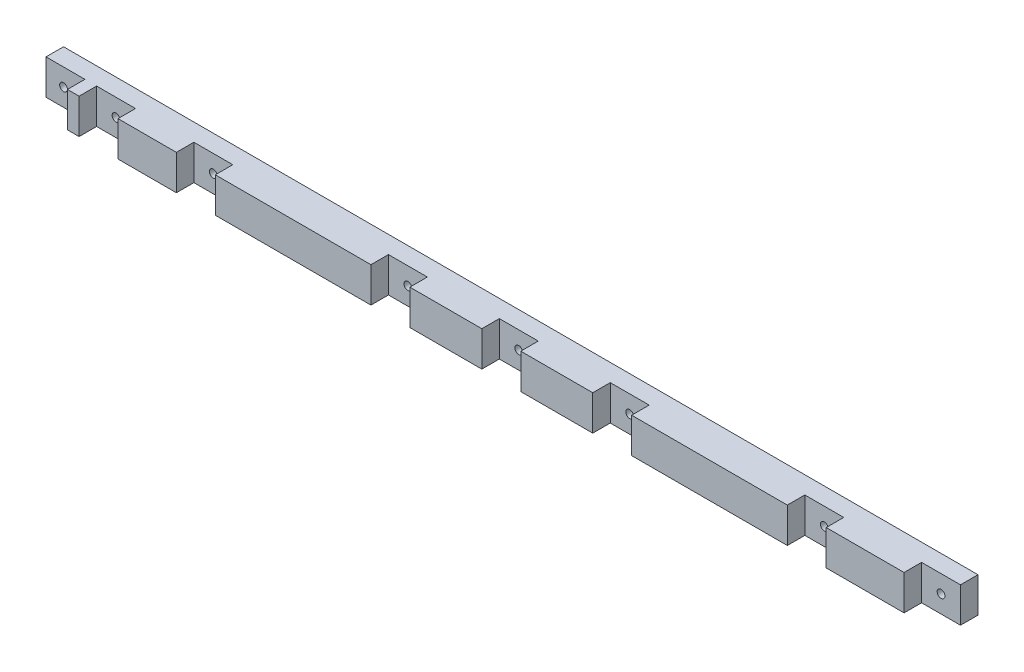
from build123d import *

# Parameters (mm, degrees)
ESQUISSE1_W              = 235
ESQUISSE1_H              = 9
EXTRUSION1_DEPTH         = 9
ESQUISSE2_W              = 10
ESQUISSE2_H              = 9
ENL_V_MAT_EXTRU_1_DEPTH  = 4.5
ESQUISSE3_R              = 1
ENL_V_MAT_EXTRU_2_DEPTH  = 4.5
ESQUISSE4_W              = 10
ESQUISSE4_H              = 9
ENL_V_MAT_EXTRU_3_DEPTH  = 4.5
ESQUISSE5_R              = 1
ENL_V_MAT_EXTRU_4_DEPTH  = 4.5
ESQUISSE6_W              = 10
ESQUISSE6_H              = 9
ENL_V_MAT_EXTRU_5_DEPTH  = 4.5
ESQUISSE7_R              = 1
ENL_V_MAT_EXTRU_6_DEPTH  = 4.5
ESQUISSE8_W              = 10
ESQUISSE8_H              = 9
ENL_V_MAT_EXTRU_7_DEPTH  = 4.5
ESQUISSE9_R              = 1
ENL_V_MAT_EXTRU_8_DEPTH  = 4.5
ESQUISSE10_W             = 10
ESQUISSE10_H             = 9
ENL_V_MAT_EXTRU_9_DEPTH  = 4.5
ESQUISSE11_R             = 1
ENL_V_MAT_EXTRU_10_DEPTH = 4.5
ESQUISSE12_W             = 10
ESQUISSE12_H             = 9
ENL_V_MAT_EXTRU_11_DEPTH = 4.5
ESQUISSE13_R             = 1
ENL_V_MAT_EXTRU_12_DEPTH = 4.5
ESQUISSE14_W             = 10
ESQUISSE14_H             = 9
ENL_V_MAT_EXTRU_13_DEPTH = 4.5
ESQUISSE15_R             = 1
ENL_V_MAT_EXTRU_14_DEPTH = 4.5
ESQUISSE16_W             = 10
ESQUISSE16_H             = 9
ENL_V_MAT_EXTRU_15_DEPTH = 4.5
ESQUISSE17_R             = 1
ENL_V_MAT_EXTRU_16_DEPTH = 4.5


with BuildPart() as part:
    # Esquisse1 → Extrusion1 (new body)
    with BuildSketch(Plane.XY):
        with Locations((117.5, 4.5)):
            Rectangle(ESQUISSE1_W, ESQUISSE1_H)
    extrude(amount=EXTRUSION1_DEPTH)

    # Esquisse2 → Enl_v. mat.-Extru.1 (cut)
    with BuildSketch(Plane.XY.offset(9)):
        with Locations((5, 4.5)):
            Rectangle(ESQUISSE2_W, ESQUISSE2_H)
    extrude(amount=-ENL_V_MAT_EXTRU_1_DEPTH, mode=Mode.SUBTRACT)

    # Esquisse3 → Enl_v. mat.-Extru.2 (cut)
    with BuildSketch(Plane.XY.offset(4.5)):
        with Locations((4.5, 4.5)):
            Circle(ESQUISSE3_R)
    extrude(amount=-ENL_V_MAT_EXTRU_2_DEPTH, mode=Mode.SUBTRACT)

    # Esquisse4 → Enl_v. mat.-Extru.3 (cut)
    with BuildSketch(Plane.XY.offset(9)):
        with Locations((18, 4.5)):
            Rectangle(ESQUISSE4_W, ESQUISSE4_H)
    extrude(amount=-ENL_V_MAT_EXTRU_3_DEPTH, mode=Mode.SUBTRACT)

    # Esquisse5 → Enl_v. mat.-Extru.4 (cut)
    with BuildSketch(Plane.XY.offset(4.5)):
        with Locations((18, 4.5)):
            Circle(ESQUISSE5_R)
    extrude(amount=-ENL_V_MAT_EXTRU_4_DEPTH, mode=Mode.SUBTRACT)

    # Esquisse6 → Enl_v. mat.-Extru.5 (cut)
    with BuildSketch(Plane.XY.offset(9)):
        with Locations((43, 4.5)):
            Rectangle(ESQUISSE6_W, ESQUISSE6_H)
    extrude(amount=-ENL_V_MAT_EXTRU_5_DEPTH, mode=Mode.SUBTRACT)

    # Esquisse7 → Enl_v. mat.-Extru.6 (cut)
    with BuildSketch(Plane.XY.offset(4.5)):
        with Locations((43, 4.5)):
            Circle(ESQUISSE7_R)
    extrude(amount=-ENL_V_MAT_EXTRU_6_DEPTH, mode=Mode.SUBTRACT)

    # Esquisse8 → Enl_v. mat.-Extru.7 (cut)
    with BuildSketch(Plane.XY.offset(9)):
        with Locations((93, 4.5)):
            Rectangle(ESQUISSE8_W, ESQUISSE8_H)
    extrude(amount=-ENL_V_MAT_EXTRU_7_DEPTH, mode=Mode.SUBTRACT)

    # Esquisse9 → Enl_v. mat.-Extru.8 (cut)
    with BuildSketch(Plane.XY.offset(4.5)):
        with Locations((93, 4.5)):
            Circle(ESQUISSE9_R)
    extrude(amount=-ENL_V_MAT_EXTRU_8_DEPTH, mode=Mode.SUBTRACT)

    # Esquisse10 → Enl_v. mat.-Extru.9 (cut)
    with BuildSketch(Plane.XY.offset(9)):
        with Locations((121.5, 4.5)):
            Rectangle(ESQUISSE10_W, ESQUISSE10_H)
    extrude(amount=-ENL_V_MAT_EXTRU_9_DEPTH, mode=Mode.SUBTRACT)

    # Esquisse11 → Enl_v. mat.-Extru.10 (cut)
    with BuildSketch(Plane.XY.offset(4.5)):
        with Locations((121.5, 4.5)):
            Circle(ESQUISSE11_R)
    extrude(amount=-ENL_V_MAT_EXTRU_10_DEPTH, mode=Mode.SUBTRACT)

    # Esquisse12 → Enl_v. mat.-Extru.11 (cut)
    with BuildSketch(Plane.XY.offset(9)):
        with Locations((150, 4.5)):
            Rectangle(ESQUISSE12_W, ESQUISSE12_H)
    extrude(amount=-ENL_V_MAT_EXTRU_11_DEPTH, mode=Mode.SUBTRACT)

    # Esquisse13 → Enl_v. mat.-Extru.12 (cut)
    with BuildSketch(Plane.XY.offset(4.5)):
        with Locations((150, 4.5)):
            Circle(ESQUISSE13_R)
    extrude(amount=-ENL_V_MAT_EXTRU_12_DEPTH, mode=Mode.SUBTRACT)

    # Esquisse14 → Enl_v. mat.-Extru.13 (cut)
    with BuildSketch(Plane.XY.offset(9)):
        with Locations((200, 4.5)):
            Rectangle(ESQUISSE14_W, ESQUISSE14_H)
    extrude(amount=-ENL_V_MAT_EXTRU_13_DEPTH, mode=Mode.SUBTRACT)

    # Esquisse15 → Enl_v. mat.-Extru.14 (cut)
    with BuildSketch(Plane.XY.offset(4.5)):
        with Locations((200, 4.5)):
            Circle(ESQUISSE15_R)
    extrude(amount=-ENL_V_MAT_EXTRU_14_DEPTH, mode=Mode.SUBTRACT)

    # Esquisse16 → Enl_v. mat.-Extru.15 (cut)
    with BuildSketch(Plane.XY.offset(9)):
        with Locations((230, 4.5)):
            Rectangle(ESQUISSE16_W, ESQUISSE16_H)
    extrude(amount=-ENL_V_MAT_EXTRU_15_DEPTH, mode=Mode.SUBTRACT)

    # Esquisse17 → Enl_v. mat.-Extru.16 (cut)
    with BuildSketch(Plane.XY.offset(4.5)):
        with Locations((230, 4.5)):
            Circle(ESQUISSE17_R)
    extrude(amount=-ENL_V_MAT_EXTRU_16_DEPTH, mode=Mode.SUBTRACT)


solid = part.part
